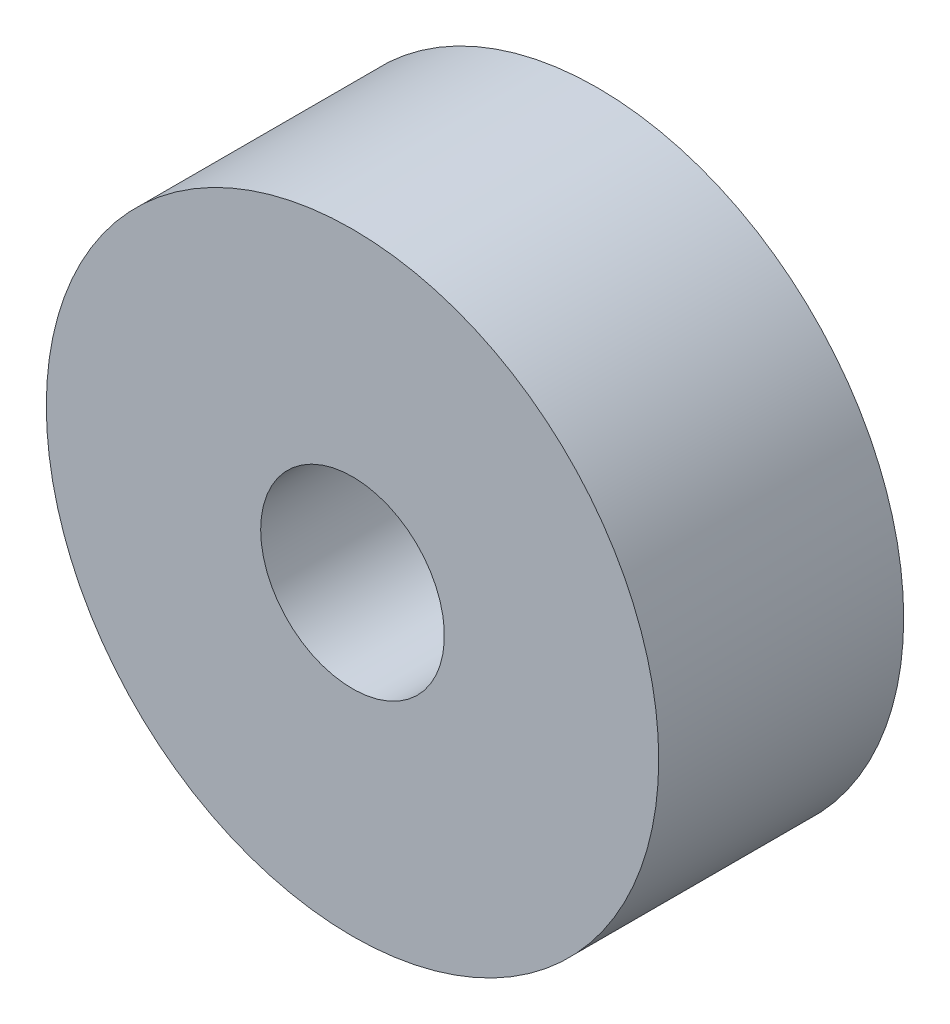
ISO-10303-21;
HEADER;
FILE_DESCRIPTION(('STEP AP214'),'2;1');
FILE_NAME('part.step','',(''),(''),'','','');
FILE_SCHEMA(('AUTOMOTIVE_DESIGN { 1 0 10303 214 1 1 1 1 }'));
ENDSEC;
DATA;
#1=APPLICATION_CONTEXT('core data for automotive mechanical design processes');
#2=APPLICATION_PROTOCOL_DEFINITION('international standard','automotive_design',2000,#1);
#3=PRODUCT_CONTEXT('',#1,'mechanical');
#4=PRODUCT('Part','Part','',(#3));
#5=PRODUCT_RELATED_PRODUCT_CATEGORY('part','',(#4));
#6=PRODUCT_DEFINITION_FORMATION('','',#4);
#7=PRODUCT_DEFINITION_CONTEXT('part definition',#1,'design');
#8=PRODUCT_DEFINITION('design','',#6,#7);
#9=PRODUCT_DEFINITION_SHAPE('','',#8);
#10=(LENGTH_UNIT() NAMED_UNIT(*) SI_UNIT(.MILLI.,.METRE.));
#11=(NAMED_UNIT(*) PLANE_ANGLE_UNIT() SI_UNIT($,.RADIAN.));
#12=(NAMED_UNIT(*) SI_UNIT($,.STERADIAN.) SOLID_ANGLE_UNIT());
#13=UNCERTAINTY_MEASURE_WITH_UNIT(LENGTH_MEASURE(1.E-05),#10,'distance_accuracy_value','');
#14=(GEOMETRIC_REPRESENTATION_CONTEXT(3) GLOBAL_UNCERTAINTY_ASSIGNED_CONTEXT((#13)) GLOBAL_UNIT_ASSIGNED_CONTEXT((#10,
#11,#12)) REPRESENTATION_CONTEXT('',''));
#15=CARTESIAN_POINT('',(0.,0.,0.));
#16=DIRECTION('',(0.,0.,1.));
#17=DIRECTION('',(1.,0.,0.));
#18=AXIS2_PLACEMENT_3D('',#15,#16,#17);
#19=CARTESIAN_POINT('',(-1.847885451,2.687462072,2.));
#20=DIRECTION('',(0.,0.,-1.));
#21=DIRECTION('',(-1.,0.,0.));
#22=AXIS2_PLACEMENT_3D('',#19,#20,#21);
#23=CYLINDRICAL_SURFACE('',#22,2.5);
#24=CARTESIAN_POINT('',(-1.847885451,2.687462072,2.));
#25=DIRECTION('',(0.,0.,-1.));
#26=DIRECTION('',(-1.,0.,0.));
#27=AXIS2_PLACEMENT_3D('',#24,#25,#26);
#28=CIRCLE('',#27,2.5);
#29=CARTESIAN_POINT('',(-4.347885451,2.687462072,2.));
#30=VERTEX_POINT('',#29);
#31=EDGE_CURVE('E19',#30,#30,#28,.F.);
#32=ORIENTED_EDGE('',*,*,#31,.F.);
#33=EDGE_LOOP('',(#32));
#34=FACE_BOUND('',#33,.T.);
#35=CARTESIAN_POINT('',(-1.847885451,2.687462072,0.));
#36=DIRECTION('',(0.,0.,-1.));
#37=DIRECTION('',(-1.,0.,0.));
#38=AXIS2_PLACEMENT_3D('',#35,#36,#37);
#39=CIRCLE('',#38,2.5);
#40=CARTESIAN_POINT('',(-4.347885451,2.687462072,0.));
#41=VERTEX_POINT('',#40);
#42=EDGE_CURVE('E28',#41,#41,#39,.F.);
#43=ORIENTED_EDGE('',*,*,#42,.T.);
#44=EDGE_LOOP('',(#43));
#45=FACE_BOUND('',#44,.T.);
#46=ADVANCED_FACE('F15',(#34,#45),#23,.T.);
#47=CARTESIAN_POINT('',(-4.377885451,0.157462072,2.));
#48=DIRECTION('',(0.,0.,1.));
#49=DIRECTION('',(1.,0.,0.));
#50=AXIS2_PLACEMENT_3D('',#47,#48,#49);
#51=PLANE('',#50);
#52=CARTESIAN_POINT('',(-1.847885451,2.687462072,2.));
#53=DIRECTION('',(0.,0.,-1.));
#54=DIRECTION('',(-1.,0.,0.));
#55=AXIS2_PLACEMENT_3D('',#52,#53,#54);
#56=CIRCLE('',#55,0.75);
#57=CARTESIAN_POINT('',(-2.597885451,2.687462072,2.));
#58=VERTEX_POINT('',#57);
#59=EDGE_CURVE('E23',#58,#58,#56,.F.);
#60=ORIENTED_EDGE('',*,*,#59,.F.);
#61=EDGE_LOOP('',(#60));
#62=FACE_BOUND('',#61,.T.);
#63=ORIENTED_EDGE('',*,*,#31,.T.);
#64=EDGE_LOOP('',(#63));
#65=FACE_BOUND('',#64,.T.);
#66=ADVANCED_FACE('F36',(#62,#65),#51,.T.);
#67=CARTESIAN_POINT('',(-4.377885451,0.157462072,0.));
#68=DIRECTION('',(0.,0.,1.));
#69=DIRECTION('',(1.,0.,0.));
#70=AXIS2_PLACEMENT_3D('',#67,#68,#69);
#71=PLANE('',#70);
#72=CARTESIAN_POINT('',(-1.847885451,2.687462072,0.));
#73=DIRECTION('',(0.,0.,-1.));
#74=DIRECTION('',(-1.,0.,0.));
#75=AXIS2_PLACEMENT_3D('',#72,#73,#74);
#76=CIRCLE('',#75,0.75);
#77=CARTESIAN_POINT('',(-2.597885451,2.687462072,0.));
#78=VERTEX_POINT('',#77);
#79=EDGE_CURVE('E10',#78,#78,#76,.T.);
#80=ORIENTED_EDGE('',*,*,#79,.F.);
#81=EDGE_LOOP('',(#80));
#82=FACE_BOUND('',#81,.T.);
#83=ORIENTED_EDGE('',*,*,#42,.F.);
#84=EDGE_LOOP('',(#83));
#85=FACE_BOUND('',#84,.T.);
#86=ADVANCED_FACE('F17',(#82,#85),#71,.F.);
#87=CARTESIAN_POINT('',(-1.847885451,2.687462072,2.));
#88=DIRECTION('',(0.,0.,-1.));
#89=DIRECTION('',(-1.,0.,0.));
#90=AXIS2_PLACEMENT_3D('',#87,#88,#89);
#91=CYLINDRICAL_SURFACE('',#90,0.75);
#92=ORIENTED_EDGE('',*,*,#79,.T.);
#93=EDGE_LOOP('',(#92));
#94=FACE_BOUND('',#93,.T.);
#95=ORIENTED_EDGE('',*,*,#59,.T.);
#96=EDGE_LOOP('',(#95));
#97=FACE_BOUND('',#96,.T.);
#98=ADVANCED_FACE('F47',(#94,#97),#91,.F.);
#99=CLOSED_SHELL('',(#46,#66,#86,#98));
#100=MANIFOLD_SOLID_BREP('B1',#99);
#101=ADVANCED_BREP_SHAPE_REPRESENTATION('',(#18,#100),#14);
#102=SHAPE_DEFINITION_REPRESENTATION(#9,#101);
ENDSEC;
END-ISO-10303-21;
